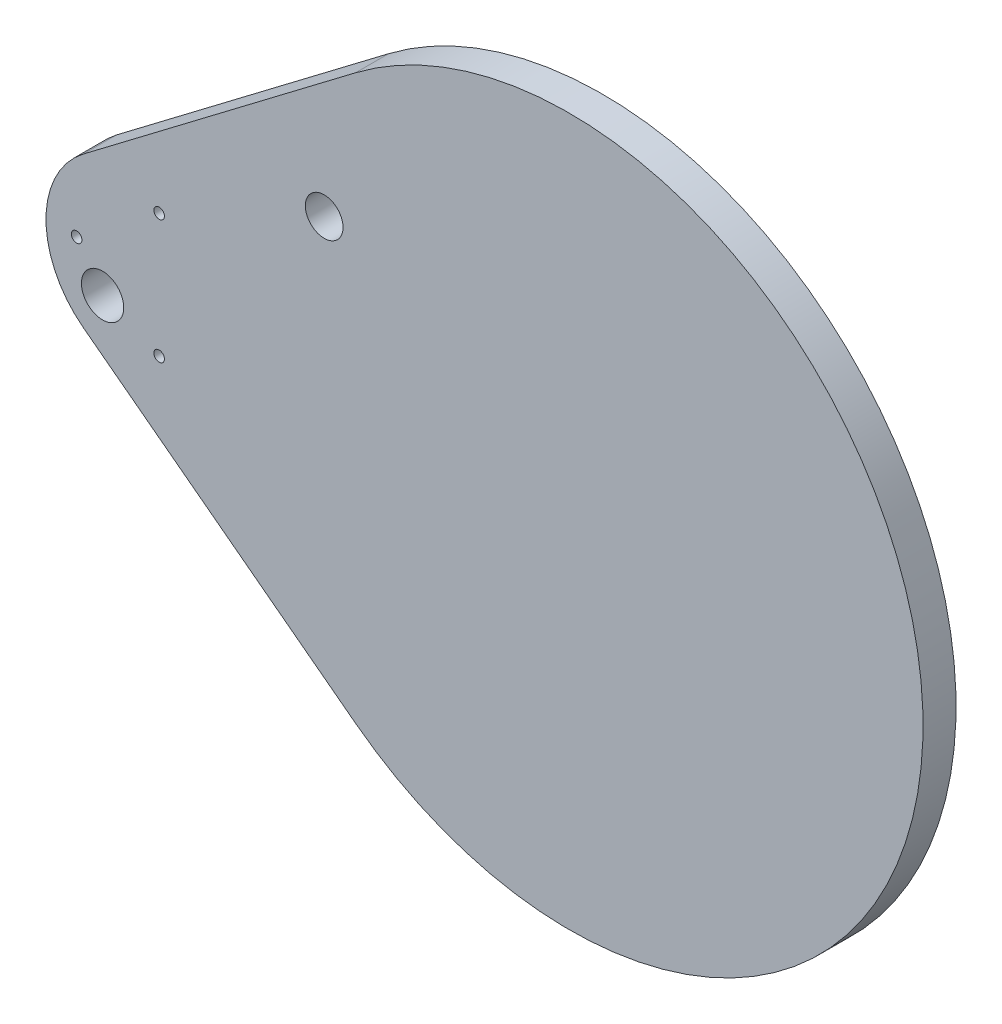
from build123d import *

# Parameters (mm, degrees)
BASE_EXTRUDE_DEPTH = 22.225
SKETCH4_R          = 11.1125
CUT_EXTRUDE1_DEPTH = 6.35
SKETCH5_R          = 14.224
CUT_EXTRUDE2_DEPTH = 426.911782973
SKETCH6_R          = 3.556
CUT_EXTRUDE3_DEPTH = 426.911782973
SKETCH7_R          = 3.556
CUT_EXTRUDE4_DEPTH = 426.911782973
SKETCH9_R          = 3.556
CUT_EXTRUDE5_DEPTH = 426.911782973
SKETCH10_R         = 12.7
CUT_EXTRUDE6_DEPTH = 426.911782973


with BuildPart() as part:
    # Sketch3 → Base-Extrude (new body)
    with BuildSketch(Plane.XY):
        with BuildLine():
            Line((-327.304120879, 50.589456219), (-143.921703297, 189.710460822))
            ThreePointArc((-143.921703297, 189.710460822), (238.125, 0), (-143.921703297, -189.710460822))
            Line((-143.921703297, -189.710460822), (-327.304120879, -50.589456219))
            ThreePointArc((-327.304120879, -50.589456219), (-352.425, 0), (-327.304120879, 50.589456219))
        make_face()
    extrude(amount=BASE_EXTRUDE_DEPTH)

    # Sketch4 → Cut-Extrude1 (cut)
    with BuildSketch(Plane(origin=(0, 0, 0), x_dir=(-1, 0, 0), z_dir=(0, 0, -1))):
        with Locations((288.925, 0)):
            Circle(SKETCH4_R)
    extrude(amount=-CUT_EXTRUDE1_DEPTH, mode=Mode.SUBTRACT)

    # Sketch5 → Cut-Extrude2 (cut, through all)
    with BuildSketch(Plane(origin=(0, 0, 0), x_dir=(-1, 0, 0), z_dir=(0, 0, -1))):
        with Locations((314.325, -25.4)):
            Circle(SKETCH5_R)
    extrude(amount=-CUT_EXTRUDE2_DEPTH, mode=Mode.SUBTRACT)

    # Sketch6 → Cut-Extrude3 (cut, through all)
    with BuildSketch(Plane(origin=(0, 0, 0), x_dir=(-1, 0, 0), z_dir=(0, 0, -1))):
        with Locations((331.7748, 0)):
            Circle(SKETCH6_R)
    extrude(amount=-CUT_EXTRUDE3_DEPTH, mode=Mode.SUBTRACT)

    # Sketch7 → Cut-Extrude4 (cut, through all)
    with BuildSketch(Plane(origin=(0, 0, 0), x_dir=(-1, 0, 0), z_dir=(0, 0, -1))):
        with Locations((276.225, 41.656)):
            Circle(SKETCH7_R)
    extrude(amount=-CUT_EXTRUDE4_DEPTH, mode=Mode.SUBTRACT)

    # Sketch9 → Cut-Extrude5 (cut, through all)
    with BuildSketch(Plane(origin=(0, 0, 0), x_dir=(-1, 0, 0), z_dir=(0, 0, -1))):
        with Locations((276.225, -41.656)):
            Circle(SKETCH9_R)
    extrude(amount=-CUT_EXTRUDE5_DEPTH, mode=Mode.SUBTRACT)

    # Sketch10 → Cut-Extrude6 (cut, through all)
    with BuildSketch(Plane(origin=(0, 0, 0), x_dir=(-1, 0, 0), z_dir=(0, 0, -1))):
        with Locations((165.1, 95.25)):
            Circle(SKETCH10_R)
    extrude(amount=-CUT_EXTRUDE6_DEPTH, mode=Mode.SUBTRACT)


solid = part.part
